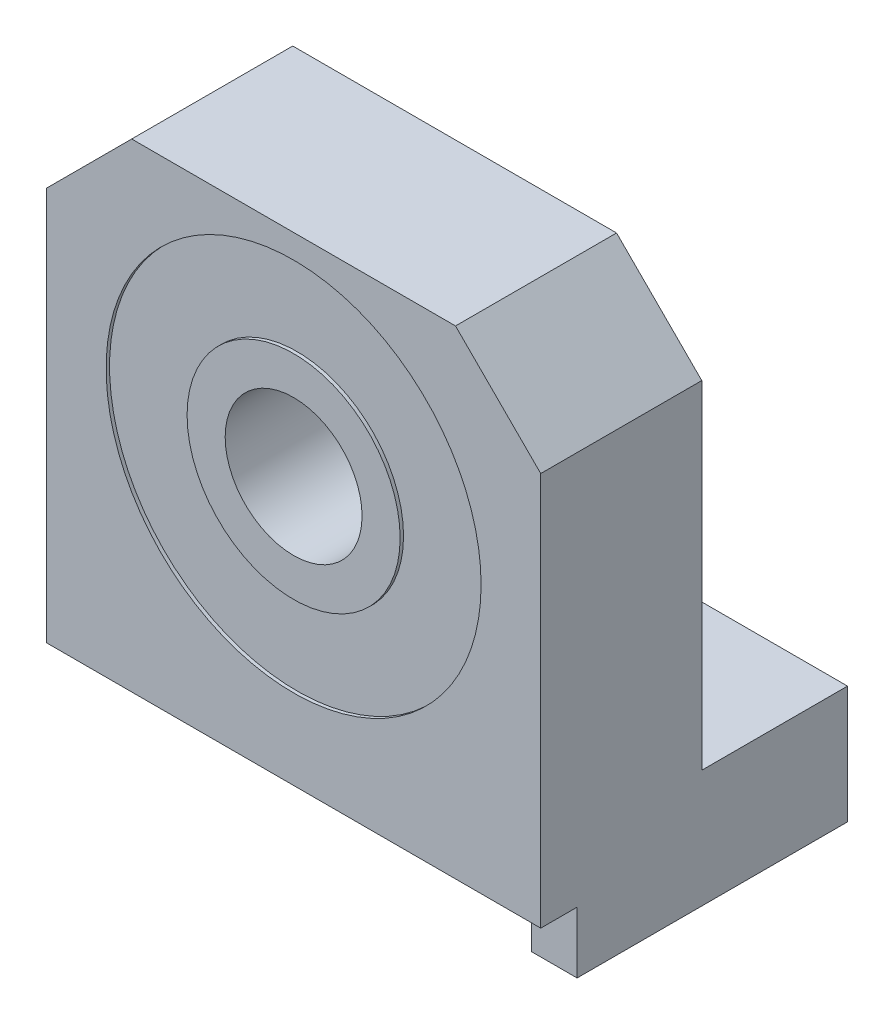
ISO-10303-21;
HEADER;
FILE_DESCRIPTION(('STEP AP214'),'2;1');
FILE_NAME('part.step','',(''),(''),'','','');
FILE_SCHEMA(('AUTOMOTIVE_DESIGN { 1 0 10303 214 1 1 1 1 }'));
ENDSEC;
DATA;
#1=APPLICATION_CONTEXT('core data for automotive mechanical design processes');
#2=APPLICATION_PROTOCOL_DEFINITION('international standard','automotive_design',2000,#1);
#3=PRODUCT_CONTEXT('',#1,'mechanical');
#4=PRODUCT('Part','Part','',(#3));
#5=PRODUCT_RELATED_PRODUCT_CATEGORY('part','',(#4));
#6=PRODUCT_DEFINITION_FORMATION('','',#4);
#7=PRODUCT_DEFINITION_CONTEXT('part definition',#1,'design');
#8=PRODUCT_DEFINITION('design','',#6,#7);
#9=PRODUCT_DEFINITION_SHAPE('','',#8);
#10=(LENGTH_UNIT() NAMED_UNIT(*) SI_UNIT(.MILLI.,.METRE.));
#11=(NAMED_UNIT(*) PLANE_ANGLE_UNIT() SI_UNIT($,.RADIAN.));
#12=(NAMED_UNIT(*) SI_UNIT($,.STERADIAN.) SOLID_ANGLE_UNIT());
#13=UNCERTAINTY_MEASURE_WITH_UNIT(LENGTH_MEASURE(1.E-05),#10,'distance_accuracy_value','');
#14=(GEOMETRIC_REPRESENTATION_CONTEXT(3) GLOBAL_UNCERTAINTY_ASSIGNED_CONTEXT((#13)) GLOBAL_UNIT_ASSIGNED_CONTEXT((#10,
#11,#12)) REPRESENTATION_CONTEXT('',''));
#15=CARTESIAN_POINT('',(0.,0.,0.));
#16=DIRECTION('',(0.,0.,1.));
#17=DIRECTION('',(1.,0.,0.));
#18=AXIS2_PLACEMENT_3D('',#15,#16,#17);
#19=CARTESIAN_POINT('',(0.,0.,11.746));
#20=DIRECTION('',(0.,0.,1.));
#21=DIRECTION('',(1.,0.,0.));
#22=AXIS2_PLACEMENT_3D('',#19,#20,#21);
#23=PLANE('',#22);
#24=CARTESIAN_POINT('',(0.,0.,11.746));
#25=DIRECTION('',(0.,0.,1.));
#26=DIRECTION('',(1.,0.,0.));
#27=AXIS2_PLACEMENT_3D('',#24,#25,#26);
#28=CIRCLE('',#27,13.97);
#29=CARTESIAN_POINT('',(13.97,0.,11.746));
#30=VERTEX_POINT('',#29);
#31=EDGE_CURVE('E362',#30,#30,#28,.T.);
#32=ORIENTED_EDGE('',*,*,#31,.T.);
#33=EDGE_LOOP('',(#32));
#34=FACE_BOUND('',#33,.T.);
#35=CARTESIAN_POINT('',(0.,0.,11.746));
#36=DIRECTION('',(0.,0.,1.));
#37=DIRECTION('',(1.,0.,0.));
#38=AXIS2_PLACEMENT_3D('',#35,#36,#37);
#39=CIRCLE('',#38,7.9375);
#40=CARTESIAN_POINT('',(7.9375,0.,11.746));
#41=VERTEX_POINT('',#40);
#42=EDGE_CURVE('E355',#41,#41,#39,.T.);
#43=ORIENTED_EDGE('',*,*,#42,.F.);
#44=EDGE_LOOP('',(#43));
#45=FACE_BOUND('',#44,.T.);
#46=ADVANCED_FACE('F39',(#34,#45),#23,.T.);
#47=CARTESIAN_POINT('',(0.,0.,0.));
#48=DIRECTION('',(0.,0.,-1.));
#49=DIRECTION('',(-1.,0.,0.));
#50=AXIS2_PLACEMENT_3D('',#47,#48,#49);
#51=CYLINDRICAL_SURFACE('',#50,5.09999999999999);
#52=CARTESIAN_POINT('',(0.,0.,0.));
#53=DIRECTION('',(0.,0.,-1.));
#54=DIRECTION('',(-1.,0.,0.));
#55=AXIS2_PLACEMENT_3D('',#52,#53,#54);
#56=CIRCLE('',#55,5.09999999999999);
#57=CARTESIAN_POINT('',(-5.09999999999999,0.,0.));
#58=VERTEX_POINT('',#57);
#59=EDGE_CURVE('E347',#58,#58,#56,.T.);
#60=ORIENTED_EDGE('',*,*,#59,.T.);
#61=EDGE_LOOP('',(#60));
#62=FACE_BOUND('',#61,.T.);
#63=CARTESIAN_POINT('',(0.,0.,12.));
#64=DIRECTION('',(0.,0.,1.));
#65=DIRECTION('',(1.,0.,0.));
#66=AXIS2_PLACEMENT_3D('',#63,#64,#65);
#67=CIRCLE('',#66,5.09999999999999);
#68=CARTESIAN_POINT('',(5.09999999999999,0.,12.));
#69=VERTEX_POINT('',#68);
#70=EDGE_CURVE('E353',#69,#69,#67,.T.);
#71=ORIENTED_EDGE('',*,*,#70,.T.);
#72=EDGE_LOOP('',(#71));
#73=FACE_BOUND('',#72,.T.);
#74=ADVANCED_FACE('F273',(#62,#73),#51,.F.);
#75=CARTESIAN_POINT('',(-18.415,17.399,12.));
#76=DIRECTION('',(1.,0.,0.));
#77=DIRECTION('',(0.,1.,0.));
#78=AXIS2_PLACEMENT_3D('',#75,#76,#77);
#79=PLANE('',#78);
#80=DIRECTION('',(0.,1.,0.));
#81=VECTOR('',#80,1.);
#82=CARTESIAN_POINT('',(-18.415,-24.511,9.28982000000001));
#83=LINE('',#82,#81);
#84=CARTESIAN_POINT('',(-18.415,-22.479,9.28982000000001));
#85=VERTEX_POINT('',#84);
#86=CARTESIAN_POINT('',(-18.415,-19.939,9.28982000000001));
#87=VERTEX_POINT('',#86);
#88=EDGE_CURVE('E365',#85,#87,#83,.T.);
#89=ORIENTED_EDGE('',*,*,#88,.T.);
#90=DIRECTION('',(0.,0.,1.));
#91=VECTOR('',#90,1.);
#92=CARTESIAN_POINT('',(-18.415,-19.939,12.));
#93=LINE('',#92,#91);
#94=CARTESIAN_POINT('',(-18.415,-19.939,12.));
#95=VERTEX_POINT('',#94);
#96=EDGE_CURVE('E334',#87,#95,#93,.T.);
#97=ORIENTED_EDGE('',*,*,#96,.T.);
#98=DIRECTION('',(0.,-1.,0.));
#99=VECTOR('',#98,1.);
#100=CARTESIAN_POINT('',(-18.415,17.399,12.));
#101=LINE('',#100,#99);
#102=CARTESIAN_POINT('',(-18.415,9.39799999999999,12.));
#103=VERTEX_POINT('',#102);
#104=EDGE_CURVE('E207',#103,#95,#101,.T.);
#105=ORIENTED_EDGE('',*,*,#104,.F.);
#106=DIRECTION('',(0.,0.,-1.));
#107=VECTOR('',#106,1.);
#108=CARTESIAN_POINT('',(-18.415,9.39799999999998,0.));
#109=LINE('',#108,#107);
#110=CARTESIAN_POINT('',(-18.415,9.39799999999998,0.));
#111=VERTEX_POINT('',#110);
#112=EDGE_CURVE('E48',#103,#111,#109,.T.);
#113=ORIENTED_EDGE('',*,*,#112,.T.);
#114=DIRECTION('',(0.,-1.,0.));
#115=VECTOR('',#114,1.);
#116=CARTESIAN_POINT('',(-18.415,17.399,0.));
#117=LINE('',#116,#115);
#118=CARTESIAN_POINT('',(-18.415,-15.748,0.));
#119=VERTEX_POINT('',#118);
#120=EDGE_CURVE('E204',#111,#119,#117,.T.);
#121=ORIENTED_EDGE('',*,*,#120,.T.);
#122=DIRECTION('',(0.,0.,1.));
#123=VECTOR('',#122,1.);
#124=CARTESIAN_POINT('',(-18.415,-15.748,-10.86));
#125=LINE('',#124,#123);
#126=CARTESIAN_POINT('',(-18.415,-15.748,-10.86));
#127=VERTEX_POINT('',#126);
#128=EDGE_CURVE('E201',#127,#119,#125,.T.);
#129=ORIENTED_EDGE('',*,*,#128,.F.);
#130=DIRECTION('',(0.,-1.,0.));
#131=VECTOR('',#130,1.);
#132=CARTESIAN_POINT('',(-18.415,-22.479,-10.86));
#133=LINE('',#132,#131);
#134=CARTESIAN_POINT('',(-18.415,-22.479,-10.86));
#135=VERTEX_POINT('',#134);
#136=EDGE_CURVE('E159',#127,#135,#133,.T.);
#137=ORIENTED_EDGE('',*,*,#136,.T.);
#138=DIRECTION('',(0.,0.,1.));
#139=VECTOR('',#138,1.);
#140=CARTESIAN_POINT('',(-18.415,-22.479,-10.86));
#141=LINE('',#140,#139);
#142=EDGE_CURVE('E226',#135,#85,#141,.T.);
#143=ORIENTED_EDGE('',*,*,#142,.T.);
#144=EDGE_LOOP('',(#89,#97,#105,#113,#121,#129,#137,#143));
#145=FACE_BOUND('',#144,.T.);
#146=ADVANCED_FACE('F224',(#145),#79,.F.);
#147=CARTESIAN_POINT('',(18.415,17.399,12.));
#148=DIRECTION('',(-1.,0.,0.));
#149=DIRECTION('',(0.,0.,1.));
#150=AXIS2_PLACEMENT_3D('',#147,#148,#149);
#151=PLANE('',#150);
#152=DIRECTION('',(0.,1.,0.));
#153=VECTOR('',#152,1.);
#154=CARTESIAN_POINT('',(18.415,17.399,12.));
#155=LINE('',#154,#153);
#156=CARTESIAN_POINT('',(18.415,-19.939,12.));
#157=VERTEX_POINT('',#156);
#158=CARTESIAN_POINT('',(18.415,9.39799999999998,12.));
#159=VERTEX_POINT('',#158);
#160=EDGE_CURVE('E209',#157,#159,#155,.T.);
#161=ORIENTED_EDGE('',*,*,#160,.F.);
#162=DIRECTION('',(0.,0.,1.));
#163=VECTOR('',#162,1.);
#164=CARTESIAN_POINT('',(18.415,-19.939,12.));
#165=LINE('',#164,#163);
#166=CARTESIAN_POINT('',(18.415,-19.939,9.28982000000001));
#167=VERTEX_POINT('',#166);
#168=EDGE_CURVE('E141',#167,#157,#165,.T.);
#169=ORIENTED_EDGE('',*,*,#168,.F.);
#170=DIRECTION('',(0.,1.,0.));
#171=VECTOR('',#170,1.);
#172=CARTESIAN_POINT('',(18.415,-24.511,9.28982000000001));
#173=LINE('',#172,#171);
#174=CARTESIAN_POINT('',(18.415,-24.511,9.28982000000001));
#175=VERTEX_POINT('',#174);
#176=EDGE_CURVE('E130',#175,#167,#173,.T.);
#177=ORIENTED_EDGE('',*,*,#176,.F.);
#178=DIRECTION('',(0.,0.,1.));
#179=VECTOR('',#178,1.);
#180=CARTESIAN_POINT('',(18.415,-24.511,-10.86));
#181=LINE('',#180,#179);
#182=CARTESIAN_POINT('',(18.415,-24.511,-10.86));
#183=VERTEX_POINT('',#182);
#184=EDGE_CURVE('E140',#183,#175,#181,.T.);
#185=ORIENTED_EDGE('',*,*,#184,.F.);
#186=DIRECTION('',(0.,1.,0.));
#187=VECTOR('',#186,1.);
#188=CARTESIAN_POINT('',(18.415,-22.479,-10.86));
#189=LINE('',#188,#187);
#190=CARTESIAN_POINT('',(18.415,-15.748,-10.86));
#191=VERTEX_POINT('',#190);
#192=EDGE_CURVE('E191',#183,#191,#189,.T.);
#193=ORIENTED_EDGE('',*,*,#192,.T.);
#194=DIRECTION('',(0.,0.,1.));
#195=VECTOR('',#194,1.);
#196=CARTESIAN_POINT('',(18.415,-15.748,-10.86));
#197=LINE('',#196,#195);
#198=CARTESIAN_POINT('',(18.415,-15.748,0.));
#199=VERTEX_POINT('',#198);
#200=EDGE_CURVE('E200',#191,#199,#197,.T.);
#201=ORIENTED_EDGE('',*,*,#200,.T.);
#202=DIRECTION('',(0.,1.,0.));
#203=VECTOR('',#202,1.);
#204=CARTESIAN_POINT('',(18.415,17.399,0.));
#205=LINE('',#204,#203);
#206=CARTESIAN_POINT('',(18.415,9.39799999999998,0.));
#207=VERTEX_POINT('',#206);
#208=EDGE_CURVE('E210',#199,#207,#205,.T.);
#209=ORIENTED_EDGE('',*,*,#208,.T.);
#210=DIRECTION('',(0.,0.,1.));
#211=VECTOR('',#210,1.);
#212=CARTESIAN_POINT('',(18.415,9.39799999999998,12.));
#213=LINE('',#212,#211);
#214=EDGE_CURVE('E166',#207,#159,#213,.T.);
#215=ORIENTED_EDGE('',*,*,#214,.T.);
#216=EDGE_LOOP('',(#161,#169,#177,#185,#193,#201,#209,#215));
#217=FACE_BOUND('',#216,.T.);
#218=ADVANCED_FACE('F138',(#217),#151,.F.);
#219=CARTESIAN_POINT('',(-18.415,17.399,12.));
#220=DIRECTION('',(0.,0.,1.));
#221=DIRECTION('',(1.,0.,0.));
#222=AXIS2_PLACEMENT_3D('',#219,#220,#221);
#223=PLANE('',#222);
#224=CARTESIAN_POINT('',(0.,0.,12.));
#225=DIRECTION('',(0.,0.,1.));
#226=DIRECTION('',(1.,0.,0.));
#227=AXIS2_PLACEMENT_3D('',#224,#225,#226);
#228=CIRCLE('',#227,13.97);
#229=CARTESIAN_POINT('',(13.97,0.,12.));
#230=VERTEX_POINT('',#229);
#231=EDGE_CURVE('E43',#230,#230,#228,.T.);
#232=ORIENTED_EDGE('',*,*,#231,.F.);
#233=EDGE_LOOP('',(#232));
#234=FACE_BOUND('',#233,.T.);
#235=DIRECTION('',(1.,0.,0.));
#236=VECTOR('',#235,1.);
#237=CARTESIAN_POINT('',(-18.415,-19.939,12.));
#238=LINE('',#237,#236);
#239=EDGE_CURVE('E336',#95,#157,#238,.T.);
#240=ORIENTED_EDGE('',*,*,#239,.T.);
#241=ORIENTED_EDGE('',*,*,#160,.T.);
#242=DIRECTION('',(-0.707106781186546,0.707106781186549,0.));
#243=VECTOR('',#242,1.);
#244=CARTESIAN_POINT('',(-4.00049999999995,31.8135,12.));
#245=LINE('',#244,#243);
#246=CARTESIAN_POINT('',(12.065,15.748,12.));
#247=VERTEX_POINT('',#246);
#248=EDGE_CURVE('E163',#159,#247,#245,.T.);
#249=ORIENTED_EDGE('',*,*,#248,.T.);
#250=DIRECTION('',(1.,0.,0.));
#251=VECTOR('',#250,1.);
#252=CARTESIAN_POINT('',(18.415,15.748,12.));
#253=LINE('',#252,#251);
#254=CARTESIAN_POINT('',(-12.065,15.748,12.));
#255=VERTEX_POINT('',#254);
#256=EDGE_CURVE('E184',#255,#247,#253,.T.);
#257=ORIENTED_EDGE('',*,*,#256,.F.);
#258=DIRECTION('',(-0.707106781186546,-0.707106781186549,0.));
#259=VECTOR('',#258,1.);
#260=CARTESIAN_POINT('',(-14.4145,13.3985,12.));
#261=LINE('',#260,#259);
#262=EDGE_CURVE('E63',#255,#103,#261,.T.);
#263=ORIENTED_EDGE('',*,*,#262,.T.);
#264=ORIENTED_EDGE('',*,*,#104,.T.);
#265=EDGE_LOOP('',(#240,#241,#249,#257,#263,#264));
#266=FACE_BOUND('',#265,.T.);
#267=ADVANCED_FACE('F265',(#234,#266),#223,.T.);
#268=CARTESIAN_POINT('',(-18.415,17.399,0.));
#269=DIRECTION('',(0.,0.,1.));
#270=DIRECTION('',(1.,0.,0.));
#271=AXIS2_PLACEMENT_3D('',#268,#269,#270);
#272=PLANE('',#271);
#273=ORIENTED_EDGE('',*,*,#59,.F.);
#274=EDGE_LOOP('',(#273));
#275=FACE_BOUND('',#274,.T.);
#276=DIRECTION('',(-1.,0.,0.));
#277=VECTOR('',#276,1.);
#278=CARTESIAN_POINT('',(18.415,15.748,0.));
#279=LINE('',#278,#277);
#280=CARTESIAN_POINT('',(12.065,15.748,0.));
#281=VERTEX_POINT('',#280);
#282=CARTESIAN_POINT('',(-12.065,15.748,0.));
#283=VERTEX_POINT('',#282);
#284=EDGE_CURVE('E239',#281,#283,#279,.T.);
#285=ORIENTED_EDGE('',*,*,#284,.F.);
#286=DIRECTION('',(0.707106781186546,-0.707106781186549,0.));
#287=VECTOR('',#286,1.);
#288=CARTESIAN_POINT('',(12.065,15.748,0.));
#289=LINE('',#288,#287);
#290=EDGE_CURVE('E169',#281,#207,#289,.T.);
#291=ORIENTED_EDGE('',*,*,#290,.T.);
#292=ORIENTED_EDGE('',*,*,#208,.F.);
#293=DIRECTION('',(-1.,0.,0.));
#294=VECTOR('',#293,1.);
#295=CARTESIAN_POINT('',(-18.415,-15.748,0.));
#296=LINE('',#295,#294);
#297=EDGE_CURVE('E179',#199,#119,#296,.T.);
#298=ORIENTED_EDGE('',*,*,#297,.T.);
#299=ORIENTED_EDGE('',*,*,#120,.F.);
#300=DIRECTION('',(0.707106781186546,0.707106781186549,0.));
#301=VECTOR('',#300,1.);
#302=CARTESIAN_POINT('',(-12.065,15.748,0.));
#303=LINE('',#302,#301);
#304=EDGE_CURVE('E171',#111,#283,#303,.T.);
#305=ORIENTED_EDGE('',*,*,#304,.T.);
#306=EDGE_LOOP('',(#285,#291,#292,#298,#299,#305));
#307=FACE_BOUND('',#306,.T.);
#308=ADVANCED_FACE('F236',(#275,#307),#272,.F.);
#309=CARTESIAN_POINT('',(-18.415,-22.479,12.));
#310=DIRECTION('',(0.,1.,0.));
#311=DIRECTION('',(-1.,0.,0.));
#312=AXIS2_PLACEMENT_3D('',#309,#310,#311);
#313=PLANE('',#312);
#314=DIRECTION('',(0.,0.,-1.));
#315=VECTOR('',#314,1.);
#316=CARTESIAN_POINT('',(14.999999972,-22.479,-10.86));
#317=LINE('',#316,#315);
#318=CARTESIAN_POINT('',(14.999999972,-22.479,9.28982000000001));
#319=VERTEX_POINT('',#318);
#320=CARTESIAN_POINT('',(14.999999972,-22.479,-10.86));
#321=VERTEX_POINT('',#320);
#322=EDGE_CURVE('E148',#319,#321,#317,.T.);
#323=ORIENTED_EDGE('',*,*,#322,.F.);
#324=DIRECTION('',(-1.,0.,0.));
#325=VECTOR('',#324,1.);
#326=CARTESIAN_POINT('',(-18.415,-22.479,9.28982000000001));
#327=LINE('',#326,#325);
#328=EDGE_CURVE('E339',#319,#85,#327,.T.);
#329=ORIENTED_EDGE('',*,*,#328,.T.);
#330=ORIENTED_EDGE('',*,*,#142,.F.);
#331=DIRECTION('',(1.,0.,0.));
#332=VECTOR('',#331,1.);
#333=CARTESIAN_POINT('',(-18.415,-22.479,-10.86));
#334=LINE('',#333,#332);
#335=EDGE_CURVE('E188',#135,#321,#334,.T.);
#336=ORIENTED_EDGE('',*,*,#335,.T.);
#337=EDGE_LOOP('',(#323,#329,#330,#336));
#338=FACE_BOUND('',#337,.T.);
#339=CARTESIAN_POINT('',(-10.500000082,-22.479,-3.960000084));
#340=DIRECTION('',(0.,1.,0.));
#341=DIRECTION('',(-1.,0.,0.));
#342=AXIS2_PLACEMENT_3D('',#339,#340,#341);
#343=CIRCLE('',#342,1.5494);
#344=CARTESIAN_POINT('',(-12.049400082,-22.479,-3.960000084));
#345=VERTEX_POINT('',#344);
#346=EDGE_CURVE('E151',#345,#345,#343,.T.);
#347=ORIENTED_EDGE('',*,*,#346,.T.);
#348=EDGE_LOOP('',(#347));
#349=FACE_BOUND('',#348,.T.);
#350=CARTESIAN_POINT('',(10.500000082,-22.479,-3.960000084));
#351=DIRECTION('',(0.,1.,0.));
#352=DIRECTION('',(-1.,0.,0.));
#353=AXIS2_PLACEMENT_3D('',#350,#351,#352);
#354=CIRCLE('',#353,1.5494);
#355=CARTESIAN_POINT('',(8.950600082,-22.479,-3.960000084));
#356=VERTEX_POINT('',#355);
#357=EDGE_CURVE('E183',#356,#356,#354,.F.);
#358=ORIENTED_EDGE('',*,*,#357,.F.);
#359=EDGE_LOOP('',(#358));
#360=FACE_BOUND('',#359,.T.);
#361=ADVANCED_FACE('F256',(#338,#349,#360),#313,.F.);
#362=CARTESIAN_POINT('',(-18.415,-15.748,-10.86));
#363=DIRECTION('',(0.,1.,0.));
#364=DIRECTION('',(0.,0.,1.));
#365=AXIS2_PLACEMENT_3D('',#362,#363,#364);
#366=PLANE('',#365);
#367=ORIENTED_EDGE('',*,*,#297,.F.);
#368=ORIENTED_EDGE('',*,*,#200,.F.);
#369=DIRECTION('',(-1.,0.,0.));
#370=VECTOR('',#369,1.);
#371=CARTESIAN_POINT('',(-18.415,-15.748,-10.86));
#372=LINE('',#371,#370);
#373=EDGE_CURVE('E197',#191,#127,#372,.T.);
#374=ORIENTED_EDGE('',*,*,#373,.T.);
#375=ORIENTED_EDGE('',*,*,#128,.T.);
#376=EDGE_LOOP('',(#367,#368,#374,#375));
#377=FACE_BOUND('',#376,.T.);
#378=CARTESIAN_POINT('',(-10.500000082,-15.748,-3.960000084));
#379=DIRECTION('',(0.,1.,0.));
#380=DIRECTION('',(0.,0.,1.));
#381=AXIS2_PLACEMENT_3D('',#378,#379,#380);
#382=CIRCLE('',#381,1.5494);
#383=CARTESIAN_POINT('',(-10.500000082,-15.748,-2.410600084));
#384=VERTEX_POINT('',#383);
#385=EDGE_CURVE('E185',#384,#384,#382,.T.);
#386=ORIENTED_EDGE('',*,*,#385,.F.);
#387=EDGE_LOOP('',(#386));
#388=FACE_BOUND('',#387,.T.);
#389=CARTESIAN_POINT('',(10.500000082,-15.748,-3.960000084));
#390=DIRECTION('',(0.,1.,0.));
#391=DIRECTION('',(0.,0.,1.));
#392=AXIS2_PLACEMENT_3D('',#389,#390,#391);
#393=CIRCLE('',#392,1.5494);
#394=CARTESIAN_POINT('',(10.500000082,-15.748,-2.410600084));
#395=VERTEX_POINT('',#394);
#396=EDGE_CURVE('E180',#395,#395,#393,.F.);
#397=ORIENTED_EDGE('',*,*,#396,.T.);
#398=EDGE_LOOP('',(#397));
#399=FACE_BOUND('',#398,.T.);
#400=ADVANCED_FACE('F230',(#377,#388,#399),#366,.T.);
#401=CARTESIAN_POINT('',(-18.415,-15.748,-10.86));
#402=DIRECTION('',(0.,0.,-1.));
#403=DIRECTION('',(-1.,0.,0.));
#404=AXIS2_PLACEMENT_3D('',#401,#402,#403);
#405=PLANE('',#404);
#406=ORIENTED_EDGE('',*,*,#335,.F.);
#407=ORIENTED_EDGE('',*,*,#136,.F.);
#408=ORIENTED_EDGE('',*,*,#373,.F.);
#409=ORIENTED_EDGE('',*,*,#192,.F.);
#410=DIRECTION('',(1.,0.,0.));
#411=VECTOR('',#410,1.);
#412=CARTESIAN_POINT('',(18.415,-24.511,-10.86));
#413=LINE('',#412,#411);
#414=CARTESIAN_POINT('',(14.999999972,-24.511,-10.86));
#415=VERTEX_POINT('',#414);
#416=EDGE_CURVE('E146',#415,#183,#413,.T.);
#417=ORIENTED_EDGE('',*,*,#416,.F.);
#418=DIRECTION('',(0.,1.,0.));
#419=VECTOR('',#418,1.);
#420=CARTESIAN_POINT('',(14.999999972,-24.511,-10.86));
#421=LINE('',#420,#419);
#422=EDGE_CURVE('E156',#415,#321,#421,.T.);
#423=ORIENTED_EDGE('',*,*,#422,.T.);
#424=EDGE_LOOP('',(#406,#407,#408,#409,#417,#423));
#425=FACE_BOUND('',#424,.T.);
#426=ADVANCED_FACE('F228',(#425),#405,.T.);
#427=CARTESIAN_POINT('',(14.999999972,-24.511,-10.86));
#428=DIRECTION('',(1.,0.,0.));
#429=DIRECTION('',(0.,0.,-1.));
#430=AXIS2_PLACEMENT_3D('',#427,#428,#429);
#431=PLANE('',#430);
#432=DIRECTION('',(0.,0.,-1.));
#433=VECTOR('',#432,1.);
#434=CARTESIAN_POINT('',(14.999999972,-24.511,-10.86));
#435=LINE('',#434,#433);
#436=CARTESIAN_POINT('',(14.999999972,-24.511,9.28982000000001));
#437=VERTEX_POINT('',#436);
#438=EDGE_CURVE('E147',#437,#415,#435,.T.);
#439=ORIENTED_EDGE('',*,*,#438,.F.);
#440=DIRECTION('',(0.,1.,0.));
#441=VECTOR('',#440,1.);
#442=CARTESIAN_POINT('',(14.999999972,-24.511,9.28982000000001));
#443=LINE('',#442,#441);
#444=EDGE_CURVE('E55',#437,#319,#443,.T.);
#445=ORIENTED_EDGE('',*,*,#444,.T.);
#446=ORIENTED_EDGE('',*,*,#322,.T.);
#447=ORIENTED_EDGE('',*,*,#422,.F.);
#448=EDGE_LOOP('',(#439,#445,#446,#447));
#449=FACE_BOUND('',#448,.T.);
#450=ADVANCED_FACE('F309',(#449),#431,.F.);
#451=CARTESIAN_POINT('',(18.415,-24.511,12.));
#452=DIRECTION('',(0.,-1.,0.));
#453=DIRECTION('',(0.,0.,-1.));
#454=AXIS2_PLACEMENT_3D('',#451,#452,#453);
#455=PLANE('',#454);
#456=DIRECTION('',(1.,0.,0.));
#457=VECTOR('',#456,1.);
#458=CARTESIAN_POINT('',(18.415,-24.511,9.28982000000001));
#459=LINE('',#458,#457);
#460=EDGE_CURVE('E13',#437,#175,#459,.T.);
#461=ORIENTED_EDGE('',*,*,#460,.F.);
#462=ORIENTED_EDGE('',*,*,#438,.T.);
#463=ORIENTED_EDGE('',*,*,#416,.T.);
#464=ORIENTED_EDGE('',*,*,#184,.T.);
#465=EDGE_LOOP('',(#461,#462,#463,#464));
#466=FACE_BOUND('',#465,.T.);
#467=ADVANCED_FACE('F144',(#466),#455,.T.);
#468=CARTESIAN_POINT('',(-10.500000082,17.399,-3.960000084));
#469=DIRECTION('',(0.,-1.,0.));
#470=DIRECTION('',(0.,0.,-1.));
#471=AXIS2_PLACEMENT_3D('',#468,#469,#470);
#472=CYLINDRICAL_SURFACE('',#471,1.5494);
#473=ORIENTED_EDGE('',*,*,#385,.T.);
#474=EDGE_LOOP('',(#473));
#475=FACE_BOUND('',#474,.T.);
#476=ORIENTED_EDGE('',*,*,#346,.F.);
#477=EDGE_LOOP('',(#476));
#478=FACE_BOUND('',#477,.T.);
#479=ADVANCED_FACE('F302',(#475,#478),#472,.F.);
#480=CARTESIAN_POINT('',(10.500000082,17.399,-3.960000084));
#481=DIRECTION('',(0.,-1.,0.));
#482=DIRECTION('',(0.,0.,-1.));
#483=AXIS2_PLACEMENT_3D('',#480,#481,#482);
#484=CYLINDRICAL_SURFACE('',#483,1.5494);
#485=ORIENTED_EDGE('',*,*,#396,.F.);
#486=EDGE_LOOP('',(#485));
#487=FACE_BOUND('',#486,.T.);
#488=ORIENTED_EDGE('',*,*,#357,.T.);
#489=EDGE_LOOP('',(#488));
#490=FACE_BOUND('',#489,.T.);
#491=ADVANCED_FACE('F254',(#487,#490),#484,.F.);
#492=CARTESIAN_POINT('',(18.415,15.748,0.));
#493=DIRECTION('',(0.,1.,0.));
#494=DIRECTION('',(0.,0.,1.));
#495=AXIS2_PLACEMENT_3D('',#492,#493,#494);
#496=PLANE('',#495);
#497=ORIENTED_EDGE('',*,*,#256,.T.);
#498=DIRECTION('',(0.,0.,-1.));
#499=VECTOR('',#498,1.);
#500=CARTESIAN_POINT('',(12.065,15.748,0.));
#501=LINE('',#500,#499);
#502=EDGE_CURVE('E173',#247,#281,#501,.T.);
#503=ORIENTED_EDGE('',*,*,#502,.T.);
#504=ORIENTED_EDGE('',*,*,#284,.T.);
#505=DIRECTION('',(0.,0.,1.));
#506=VECTOR('',#505,1.);
#507=CARTESIAN_POINT('',(-12.065,15.748,12.));
#508=LINE('',#507,#506);
#509=EDGE_CURVE('E176',#283,#255,#508,.T.);
#510=ORIENTED_EDGE('',*,*,#509,.T.);
#511=EDGE_LOOP('',(#497,#503,#504,#510));
#512=FACE_BOUND('',#511,.T.);
#513=ADVANCED_FACE('F246',(#512),#496,.T.);
#514=CARTESIAN_POINT('',(12.065,15.748,0.));
#515=DIRECTION('',(0.707106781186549,0.707106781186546,0.));
#516=DIRECTION('',(-0.707106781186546,0.707106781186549,0.));
#517=AXIS2_PLACEMENT_3D('',#514,#515,#516);
#518=PLANE('',#517);
#519=ORIENTED_EDGE('',*,*,#248,.F.);
#520=ORIENTED_EDGE('',*,*,#214,.F.);
#521=ORIENTED_EDGE('',*,*,#290,.F.);
#522=ORIENTED_EDGE('',*,*,#502,.F.);
#523=EDGE_LOOP('',(#519,#520,#521,#522));
#524=FACE_BOUND('',#523,.T.);
#525=ADVANCED_FACE('F243',(#524),#518,.T.);
#526=CARTESIAN_POINT('',(-12.065,15.748,0.));
#527=DIRECTION('',(-0.707106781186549,0.707106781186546,0.));
#528=DIRECTION('',(-0.707106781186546,-0.707106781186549,0.));
#529=AXIS2_PLACEMENT_3D('',#526,#527,#528);
#530=PLANE('',#529);
#531=ORIENTED_EDGE('',*,*,#304,.F.);
#532=ORIENTED_EDGE('',*,*,#112,.F.);
#533=ORIENTED_EDGE('',*,*,#262,.F.);
#534=ORIENTED_EDGE('',*,*,#509,.F.);
#535=EDGE_LOOP('',(#531,#532,#533,#534));
#536=FACE_BOUND('',#535,.T.);
#537=ADVANCED_FACE('F41',(#536),#530,.T.);
#538=CARTESIAN_POINT('',(-18.415,-24.511,9.28982000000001));
#539=DIRECTION('',(0.,0.,-1.));
#540=DIRECTION('',(-1.,0.,0.));
#541=AXIS2_PLACEMENT_3D('',#538,#539,#540);
#542=PLANE('',#541);
#543=ORIENTED_EDGE('',*,*,#444,.F.);
#544=ORIENTED_EDGE('',*,*,#460,.T.);
#545=ORIENTED_EDGE('',*,*,#176,.T.);
#546=DIRECTION('',(1.,0.,0.));
#547=VECTOR('',#546,1.);
#548=CARTESIAN_POINT('',(-18.415,-19.939,9.28982000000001));
#549=LINE('',#548,#547);
#550=EDGE_CURVE('E337',#87,#167,#549,.T.);
#551=ORIENTED_EDGE('',*,*,#550,.F.);
#552=ORIENTED_EDGE('',*,*,#88,.F.);
#553=ORIENTED_EDGE('',*,*,#328,.F.);
#554=EDGE_LOOP('',(#543,#544,#545,#551,#552,#553));
#555=FACE_BOUND('',#554,.T.);
#556=ADVANCED_FACE('F129',(#555),#542,.F.);
#557=CARTESIAN_POINT('',(-18.415,-19.939,12.));
#558=DIRECTION('',(0.,1.,0.));
#559=DIRECTION('',(0.,0.,1.));
#560=AXIS2_PLACEMENT_3D('',#557,#558,#559);
#561=PLANE('',#560);
#562=ORIENTED_EDGE('',*,*,#239,.F.);
#563=ORIENTED_EDGE('',*,*,#96,.F.);
#564=ORIENTED_EDGE('',*,*,#550,.T.);
#565=ORIENTED_EDGE('',*,*,#168,.T.);
#566=EDGE_LOOP('',(#562,#563,#564,#565));
#567=FACE_BOUND('',#566,.T.);
#568=ADVANCED_FACE('F291',(#567),#561,.F.);
#569=CARTESIAN_POINT('',(0.,0.,11.746));
#570=DIRECTION('',(0.,0.,1.));
#571=DIRECTION('',(1.,0.,0.));
#572=AXIS2_PLACEMENT_3D('',#569,#570,#571);
#573=CYLINDRICAL_SURFACE('',#572,13.97);
#574=ORIENTED_EDGE('',*,*,#231,.T.);
#575=EDGE_LOOP('',(#574));
#576=FACE_BOUND('',#575,.T.);
#577=ORIENTED_EDGE('',*,*,#31,.F.);
#578=EDGE_LOOP('',(#577));
#579=FACE_BOUND('',#578,.T.);
#580=ADVANCED_FACE('F287',(#576,#579),#573,.F.);
#581=CARTESIAN_POINT('',(0.,0.,12.));
#582=DIRECTION('',(0.,0.,1.));
#583=DIRECTION('',(1.,0.,0.));
#584=AXIS2_PLACEMENT_3D('',#581,#582,#583);
#585=PLANE('',#584);
#586=CARTESIAN_POINT('',(0.,0.,12.));
#587=DIRECTION('',(0.,0.,1.));
#588=DIRECTION('',(1.,0.,0.));
#589=AXIS2_PLACEMENT_3D('',#586,#587,#588);
#590=CIRCLE('',#589,7.9375);
#591=CARTESIAN_POINT('',(7.9375,0.,12.));
#592=VERTEX_POINT('',#591);
#593=EDGE_CURVE('E358',#592,#592,#590,.T.);
#594=ORIENTED_EDGE('',*,*,#593,.T.);
#595=EDGE_LOOP('',(#594));
#596=FACE_BOUND('',#595,.T.);
#597=ORIENTED_EDGE('',*,*,#70,.F.);
#598=EDGE_LOOP('',(#597));
#599=FACE_BOUND('',#598,.T.);
#600=ADVANCED_FACE('F290',(#596,#599),#585,.T.);
#601=CARTESIAN_POINT('',(0.,0.,12.));
#602=DIRECTION('',(0.,0.,-1.));
#603=DIRECTION('',(-1.,0.,0.));
#604=AXIS2_PLACEMENT_3D('',#601,#602,#603);
#605=CYLINDRICAL_SURFACE('',#604,7.9375);
#606=ORIENTED_EDGE('',*,*,#593,.F.);
#607=EDGE_LOOP('',(#606));
#608=FACE_BOUND('',#607,.T.);
#609=ORIENTED_EDGE('',*,*,#42,.T.);
#610=EDGE_LOOP('',(#609));
#611=FACE_BOUND('',#610,.T.);
#612=ADVANCED_FACE('F285',(#608,#611),#605,.T.);
#613=CLOSED_SHELL('',(#46,#74,#146,#218,#267,#308,#361,#400,#426,#450,#467,#479,#491,#513,#525,
#537,#556,#568,#580,#600,#612));
#614=MANIFOLD_SOLID_BREP('B2',#613);
#615=ADVANCED_BREP_SHAPE_REPRESENTATION('',(#18,#614),#14);
#616=SHAPE_DEFINITION_REPRESENTATION(#9,#615);
ENDSEC;
END-ISO-10303-21;
